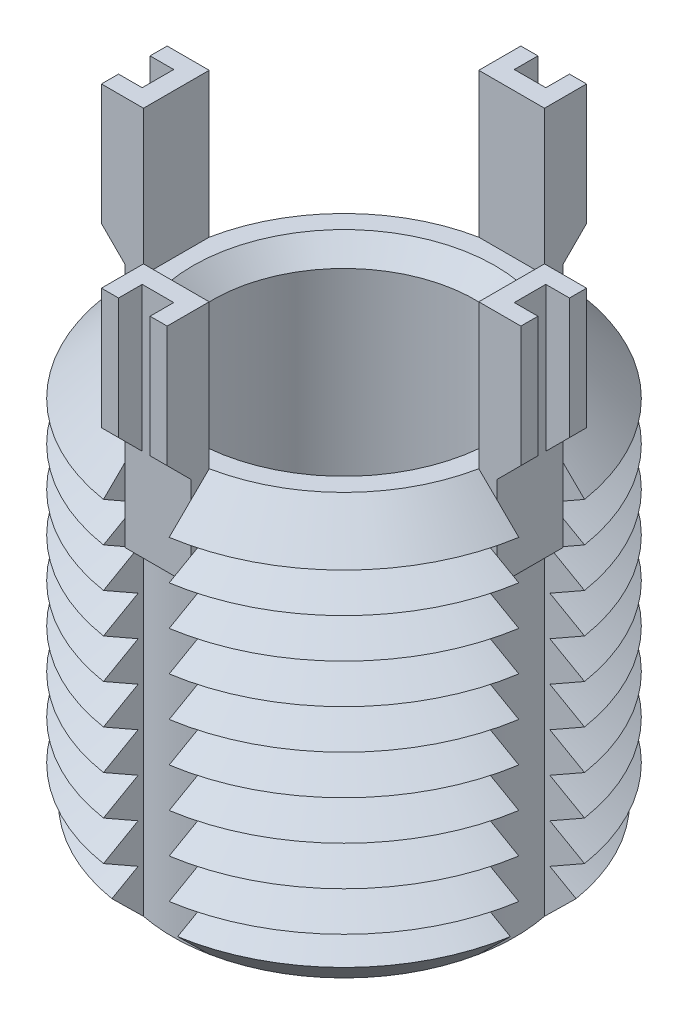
from build123d import *

# Parameters (mm, degrees)
SKETCH1_R               = 8
BOSS_EXTRUDE1_DEPTH     = 16
CHAMFER1_SIZE           = 1.5
LPATTERN1_COUNT         = 9
LPATTERN1_PITCH         = 1.5
CUT_EXTRUDE1_REACH      = 21.596
CIRPATTERN1_COUNT       = 4
BOSS_EXTRUDE3_DEPTH     = 1.25
CIRPATTERN2_COUNT       = 4
CUT_EXTRUDE3_DEPTH      = 25.281032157
CUT_EXTRUDE3_DEPTH_BACK = 25.281032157
SKETCH6_W               = 0.9
SKETCH6_H               = 1.2
SKETCH6_W_2             = 1.2
SKETCH6_H_2             = 0.9
SKETCH7_R               = 5
CUT_EXTRUDE4_DEPTH      = 16
CHAMFER2_SIZE           = 0.75


with BuildPart() as part:
    # Sketch1 → Boss-Extrude1 (new body)
    with BuildSketch(Plane(origin=(0, 0, 0), x_dir=(1, 0, 0), z_dir=(0, 1, 0))):
        with Locations(Location((0, 0, 0), (0, 0, 270))):
            Circle(SKETCH1_R)
    extrude(amount=-BOSS_EXTRUDE1_DEPTH)

    # Chamfer1
    chamfer1_edges = [part.edges().sort_by_distance(p)[0] for p in [
        (0, 0, -8),
        (0, -16, -8),
    ]]
    chamfer(chamfer1_edges, length=CHAMFER1_SIZE)

    # Sketch3 → Cut-Revolve1 (revolve, cut)
    with BuildSketch(Plane(origin=(0, 0, 0), x_dir=(0, 0, -1), z_dir=(1, 0, 0))):
        Polygon((-8, -1.5), (-6.700961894, -2.25), (-8, -3), align=None)
    cut_revolve1 = revolve(axis=Axis((0, 0.885892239, 0), (0, -1, 0)), mode=Mode.SUBTRACT)

    # LPattern1: Cut-Revolve1 ×9
    with Locations(*[(0, -i * LPATTERN1_PITCH, 0) for i in range(1, LPATTERN1_COUNT)]):
        add(cut_revolve1, mode=Mode.SUBTRACT)

    # Cut-Extrude1: up to this cone (the profile starts inside it)
    cut_extrude1_end = Plane(origin=(0, 0, 0), z_dir=(0, 1, 0)).offset(-22.499999) * Cone(1e-06, 67.096, 67.095999, align=(Align.CENTER, Align.CENTER, Align.MIN), mode=Mode.PRIVATE)
    # Sketch4 → Cut-Extrude1 (cut, up to the surface)
    with BuildSketch(Plane(origin=(0, 0, 0), x_dir=(1, 0, 0), z_dir=(0, 1, 0)), mode=Mode.PRIVATE) as cut_extrude1_sk1:
        with BuildLine():
            Line((-6.378675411, 1.25), (-7.901740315, 1.25))
            ThreePointArc((-7.901740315, 1.25), (-8, 0), (-7.901740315, -1.25))
            Line((-7.901740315, -1.25), (-6.378675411, -1.25))
            ThreePointArc((-6.378675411, -1.25), (-6.5, 0), (-6.378675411, 1.25))
        make_face()
    cut_extrude1_tool1 = extrude(cut_extrude1_sk1.sketch, amount=-CUT_EXTRUDE1_REACH, mode=Mode.PRIVATE) & cut_extrude1_end
    cut_extrude1 = cut_extrude1_tool1.solids().sort_by_distance((-7.213371, 0, 0))[0]
    add(cut_extrude1, mode=Mode.SUBTRACT)

    # CirPattern1: Cut-Extrude1 ×4 about axis
    cirpattern1_axis = Axis((0, 0, 0), (0, 1, 0))
    for i in range(1, CIRPATTERN1_COUNT):
        add(cut_extrude1.rotate(cirpattern1_axis, i * 360 / CIRPATTERN1_COUNT), mode=Mode.SUBTRACT)

    # Sketch5 → Boss-Extrude3 (add, symmetric)
    with BuildSketch(Plane(origin=(0, 0, 0), x_dir=(0, 0, -1), z_dir=(1, 0, 0))):
        Polygon((-6.378675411, 5.5), (-6.378675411, -3.5), (-7.078675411, -3.5), (-7.078675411, 0), (-7.978675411, 0.9), (-7.978675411, 5.5), align=None)
    boss_extrude3 = extrude(amount=BOSS_EXTRUDE3_DEPTH, both=True)

    # CirPattern2: Boss-Extrude3 ×4 about axis
    cirpattern2_axis = Axis((0, 0, 0), (0, 1, 0))
    for i in range(1, CIRPATTERN2_COUNT):
        add(boss_extrude3.rotate(cirpattern2_axis, i * 360 / CIRPATTERN2_COUNT))

    # Sketch6 → Cut-Extrude3 (cut, two sides: drawn at the far end of the back side and taken through both)
    with BuildSketch(Plane(origin=(0, 5.5, 0), x_dir=(1, 0, 0), z_dir=(0, 1, 0)).offset(-CUT_EXTRUDE3_DEPTH_BACK)):
        with Locations((-7.528675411, 0)):
            Rectangle(SKETCH6_W, SKETCH6_H)
        with Locations((0, 7.528675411)):
            Rectangle(SKETCH6_W_2, SKETCH6_H_2)
        with Locations((7.528675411, 0)):
            Rectangle(SKETCH6_W, SKETCH6_H)
        with Locations((0, -7.528675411)):
            Rectangle(SKETCH6_W_2, SKETCH6_H_2)
    extrude(amount=CUT_EXTRUDE3_DEPTH + CUT_EXTRUDE3_DEPTH_BACK, mode=Mode.SUBTRACT)

    # Sketch7 → Cut-Extrude4 (cut)
    with BuildSketch(Plane(origin=(0, 0, 0), x_dir=(1, 0, 0), z_dir=(0, 1, 0))):
        with Locations(Location((0, 0, 0), (0, 0, 270))):
            Circle(SKETCH7_R)
    extrude(amount=-CUT_EXTRUDE4_DEPTH, mode=Mode.SUBTRACT)

    # Chamfer2
    chamfer2_edges = [part.edges().sort_by_distance(p)[0] for p in [
        (0, 0, -5),
        (0, -16, -5),
    ]]
    chamfer(chamfer2_edges, length=CHAMFER2_SIZE)


solid = part.part
